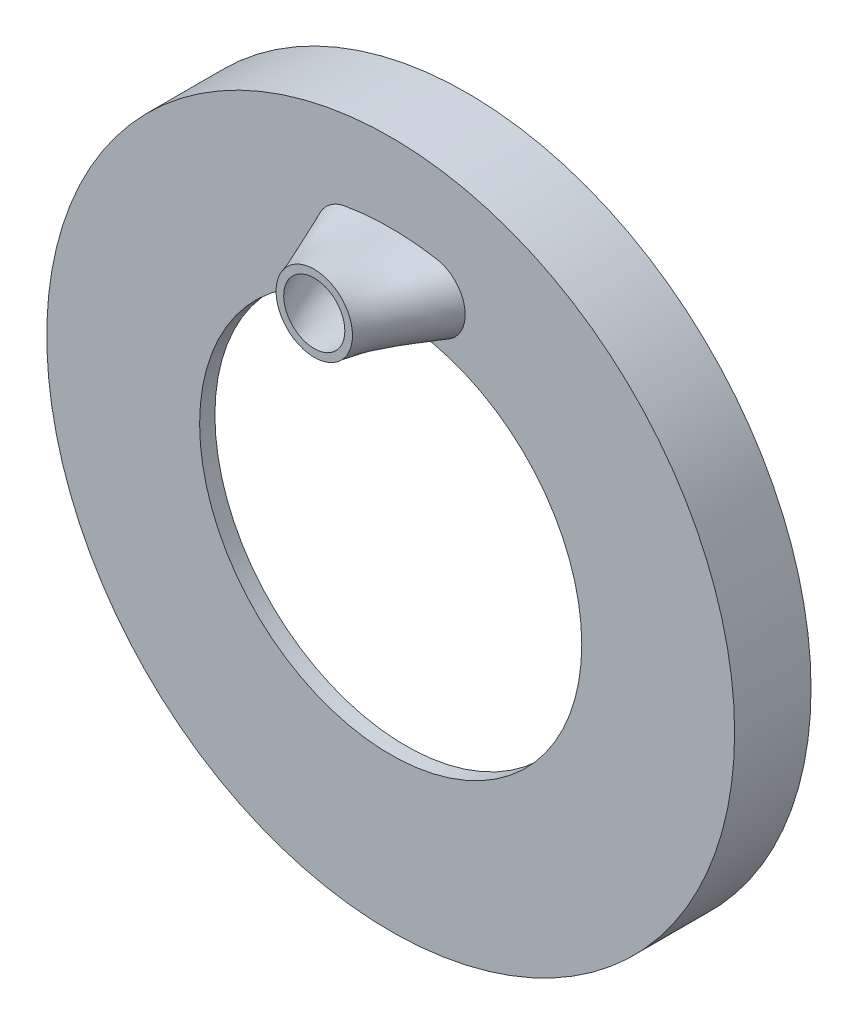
ISO-10303-21;
HEADER;
FILE_DESCRIPTION(('STEP AP214'),'2;1');
FILE_NAME('part.step','',(''),(''),'','','');
FILE_SCHEMA(('AUTOMOTIVE_DESIGN { 1 0 10303 214 1 1 1 1 }'));
ENDSEC;
DATA;
#1=APPLICATION_CONTEXT('core data for automotive mechanical design processes');
#2=APPLICATION_PROTOCOL_DEFINITION('international standard','automotive_design',2000,#1);
#3=PRODUCT_CONTEXT('',#1,'mechanical');
#4=PRODUCT('Part','Part','',(#3));
#5=PRODUCT_RELATED_PRODUCT_CATEGORY('part','',(#4));
#6=PRODUCT_DEFINITION_FORMATION('','',#4);
#7=PRODUCT_DEFINITION_CONTEXT('part definition',#1,'design');
#8=PRODUCT_DEFINITION('design','',#6,#7);
#9=PRODUCT_DEFINITION_SHAPE('','',#8);
#10=(LENGTH_UNIT() NAMED_UNIT(*) SI_UNIT(.MILLI.,.METRE.));
#11=(NAMED_UNIT(*) PLANE_ANGLE_UNIT() SI_UNIT($,.RADIAN.));
#12=(NAMED_UNIT(*) SI_UNIT($,.STERADIAN.) SOLID_ANGLE_UNIT());
#13=UNCERTAINTY_MEASURE_WITH_UNIT(LENGTH_MEASURE(1.E-05),#10,'distance_accuracy_value','');
#14=(GEOMETRIC_REPRESENTATION_CONTEXT(3) GLOBAL_UNCERTAINTY_ASSIGNED_CONTEXT((#13)) GLOBAL_UNIT_ASSIGNED_CONTEXT((#10,
#11,#12)) REPRESENTATION_CONTEXT('',''));
#15=CARTESIAN_POINT('',(0.,0.,0.));
#16=DIRECTION('',(0.,0.,1.));
#17=DIRECTION('',(1.,0.,0.));
#18=AXIS2_PLACEMENT_3D('',#15,#16,#17);
#19=CARTESIAN_POINT('',(0.,0.,2.));
#20=DIRECTION('',(0.,0.,1.));
#21=DIRECTION('',(1.,0.,0.));
#22=AXIS2_PLACEMENT_3D('',#19,#20,#21);
#23=PLANE('',#22);
#24=CARTESIAN_POINT('',(0.,0.,2.));
#25=DIRECTION('',(0.,0.,1.));
#26=DIRECTION('',(1.,0.,0.));
#27=AXIS2_PLACEMENT_3D('',#24,#25,#26);
#28=CIRCLE('',#27,25.);
#29=CARTESIAN_POINT('',(25.,0.,2.));
#30=VERTEX_POINT('',#29);
#31=EDGE_CURVE('E426',#30,#30,#28,.T.);
#32=ORIENTED_EDGE('',*,*,#31,.F.);
#33=EDGE_LOOP('',(#32));
#34=FACE_BOUND('',#33,.T.);
#35=CARTESIAN_POINT('',(0.,0.,2.));
#36=DIRECTION('',(0.,0.,1.));
#37=DIRECTION('',(1.,0.,0.));
#38=AXIS2_PLACEMENT_3D('',#35,#36,#37);
#39=CIRCLE('',#38,45.);
#40=CARTESIAN_POINT('',(45.,0.,2.));
#41=VERTEX_POINT('',#40);
#42=EDGE_CURVE('E429',#41,#41,#39,.T.);
#43=ORIENTED_EDGE('',*,*,#42,.T.);
#44=EDGE_LOOP('',(#43));
#45=FACE_BOUND('',#44,.T.);
#46=CARTESIAN_POINT('',(4.46275816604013,25.3095592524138,2.));
#47=CARTESIAN_POINT('',(4.71172962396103,25.2656934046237,2.));
#48=CARTESIAN_POINT('',(4.9643897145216,25.2429222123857,2.));
#49=CARTESIAN_POINT('',(5.46978503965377,25.2397887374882,2.));
#50=CARTESIAN_POINT('',(5.72252008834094,25.2593958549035,2.));
#51=CARTESIAN_POINT('',(6.22125291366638,25.3411926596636,2.));
#52=CARTESIAN_POINT('',(6.46724767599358,25.4034010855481,2.));
#53=CARTESIAN_POINT('',(6.82564758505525,25.5265427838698,2.));
#54=CARTESIAN_POINT('',(6.94339008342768,25.572583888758,2.));
#55=CARTESIAN_POINT('',(7.17464037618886,25.6743578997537,2.));
#56=CARTESIAN_POINT('',(7.28814854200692,25.7300899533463,2.));
#57=CARTESIAN_POINT('',(7.51039040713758,25.8511651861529,2.));
#58=CARTESIAN_POINT('',(7.61910743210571,25.9165389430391,2.));
#59=CARTESIAN_POINT('',(7.83054752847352,26.0563617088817,2.));
#60=CARTESIAN_POINT('',(7.93327026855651,26.1308112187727,2.));
#61=CARTESIAN_POINT('',(8.13212330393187,26.2880554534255,2.));
#62=CARTESIAN_POINT('',(8.22825302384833,26.3708509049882,2.));
#63=CARTESIAN_POINT('',(8.41326793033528,26.5441779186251,2.));
#64=CARTESIAN_POINT('',(8.50215303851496,26.6347095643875,2.));
#65=CARTESIAN_POINT('',(8.6719291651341,26.8228105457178,2.));
#66=CARTESIAN_POINT('',(8.75282865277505,26.9203722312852,2.));
#67=CARTESIAN_POINT('',(8.90598947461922,27.1220483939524,2.));
#68=CARTESIAN_POINT('',(8.97825155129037,27.2261623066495,2.));
#69=CARTESIAN_POINT('',(9.11359730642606,27.4401705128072,2.));
#70=CARTESIAN_POINT('',(9.176682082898,27.5500641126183,2.));
#71=CARTESIAN_POINT('',(9.29346483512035,27.7747442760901,2.));
#72=CARTESIAN_POINT('',(9.34716153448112,27.8895315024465,2.));
#73=CARTESIAN_POINT('',(9.4446747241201,28.1228341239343,2.));
#74=CARTESIAN_POINT('',(9.48851965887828,28.2413376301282,2.));
#75=CARTESIAN_POINT('',(9.56617008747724,28.4815759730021,2.));
#76=CARTESIAN_POINT('',(9.59997702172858,28.6033103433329,2.));
#77=CARTESIAN_POINT('',(9.65707409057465,28.8492347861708,2.));
#78=CARTESIAN_POINT('',(9.68036354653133,28.9734250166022,2.));
#79=CARTESIAN_POINT('',(9.7162546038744,29.2233459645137,2.));
#80=CARTESIAN_POINT('',(9.7288552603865,29.3490768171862,2.));
#81=CARTESIAN_POINT('',(9.7435241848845,29.6009731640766,2.));
#82=CARTESIAN_POINT('',(9.74560687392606,29.7271378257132,2.));
#83=CARTESIAN_POINT('',(9.73931566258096,29.9792059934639,2.));
#84=CARTESIAN_POINT('',(9.73094176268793,30.1051094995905,2.));
#85=CARTESIAN_POINT('',(9.70375500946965,30.3557989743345,2.));
#86=CARTESIAN_POINT('',(9.68494136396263,30.480584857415,2.));
#87=CARTESIAN_POINT('',(9.63675610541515,30.7280958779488,2.));
#88=CARTESIAN_POINT('',(9.60738538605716,30.8508211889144,2.));
#89=CARTESIAN_POINT('',(9.5381374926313,31.0938694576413,2.));
#90=CARTESIAN_POINT('',(9.49821318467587,31.2141789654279,2.));
#91=CARTESIAN_POINT('',(9.40842293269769,31.4510429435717,2.));
#92=CARTESIAN_POINT('',(9.35855561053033,31.5675968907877,2.));
#93=CARTESIAN_POINT('',(9.24928097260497,31.7961399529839,2.));
#94=CARTESIAN_POINT('',(9.18987385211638,31.9081291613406,2.));
#95=CARTESIAN_POINT('',(9.06191096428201,32.1267386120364,2.));
#96=CARTESIAN_POINT('',(8.99335641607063,32.2333595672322,2.));
#97=CARTESIAN_POINT('',(8.84716984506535,32.4406360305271,2.));
#98=CARTESIAN_POINT('',(8.76951310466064,32.5412741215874,2.));
#99=CARTESIAN_POINT('',(8.60588552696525,32.73555805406,2.));
#100=CARTESIAN_POINT('',(8.51991384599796,32.8292031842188,2.));
#101=CARTESIAN_POINT('',(8.34038067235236,33.0089565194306,2.));
#102=CARTESIAN_POINT('',(8.24681720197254,33.0950627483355,2.));
#103=CARTESIAN_POINT('',(8.05281844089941,33.259131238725,2.));
#104=CARTESIAN_POINT('',(7.95238361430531,33.3370940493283,2.));
#105=CARTESIAN_POINT('',(7.74563490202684,33.4840373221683,2.));
#106=CARTESIAN_POINT('',(7.63934205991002,33.5530472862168,2.));
#107=CARTESIAN_POINT('',(7.42128595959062,33.6817250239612,2.));
#108=CARTESIAN_POINT('',(7.30952211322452,33.741391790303,2.));
#109=CARTESIAN_POINT('',(6.96756689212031,33.9057259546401,2.));
#110=CARTESIAN_POINT('',(6.73019049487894,33.9960964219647,2.));
#111=CARTESIAN_POINT('',(6.41133711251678,34.0878280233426,2.));
#112=CARTESIAN_POINT('',(6.33475731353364,34.1076935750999,2.));
#113=CARTESIAN_POINT('',(6.18078370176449,34.1433274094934,2.));
#114=CARTESIAN_POINT('',(6.10339144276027,34.1591024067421,2.));
#115=CARTESIAN_POINT('',(6.02559176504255,34.1728290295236,2.));
#116=B_SPLINE_CURVE_WITH_KNOTS('',3,(#46,#47,#48,#49,#50,#51,#52,#53,#54,#55,#56,#57,#58,#59,
#60,#61,#62,#63,#64,#65,#66,#67,#68,#69,#70,#71,#72,#73,#74,#75,#76,#77,#78,#79,#80,#81,#82,#83,
#84,#85,#86,#87,#88,#89,#90,#91,#92,#93,#94,#95,#96,#97,#98,#99,#100,#101,#102,#103,#104,#105,
#106,#107,#108,#109,#110,#111,#112,#113,#114,#115),.UNSPECIFIED.,.F.,.F.,(4,2,2,2,2,2,2,2,2,2,2,
2,2,2,2,2,2,2,2,2,2,2,2,2,2,2,2,2,2,2,2,2,2,2,4),(0.,0.757497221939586,1.51444766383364,
2.27173127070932,2.65065109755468,3.02953760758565,3.40965263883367,3.78978865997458,
4.16995781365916,4.55013108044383,4.92989671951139,5.3096296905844,5.68931719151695,
6.0690562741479,6.44768445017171,6.82625826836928,7.20485651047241,7.58348821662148,
7.96160064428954,8.33971305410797,8.71785415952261,9.0959632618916,9.47579045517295,
9.85567033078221,10.2355424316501,10.6153639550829,10.9962419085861,11.3771585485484,
11.7581747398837,12.1391652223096,12.5188665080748,12.8986087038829,13.6561993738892,
13.8934775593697,14.1303637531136),.UNSPECIFIED.);
#117=CARTESIAN_POINT('',(4.46275816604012,25.3095592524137,2.));
#118=VERTEX_POINT('',#117);
#119=CARTESIAN_POINT('',(6.02559176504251,34.1728290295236,2.));
#120=VERTEX_POINT('',#119);
#121=EDGE_CURVE('E401',#118,#120,#116,.T.);
#122=ORIENTED_EDGE('',*,*,#121,.F.);
#123=CARTESIAN_POINT('',(4.46275816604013,25.3095592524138,2.));
#124=CARTESIAN_POINT('',(4.30344442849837,25.3376633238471,2.));
#125=CARTESIAN_POINT('',(4.14387814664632,25.3643559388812,2.));
#126=CARTESIAN_POINT('',(3.82427556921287,25.414747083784,2.));
#127=CARTESIAN_POINT('',(3.66423927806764,25.4384456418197,2.));
#128=CARTESIAN_POINT('',(3.34371848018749,25.4826794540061,2.));
#129=CARTESIAN_POINT('',(3.18323394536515,25.5032145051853,2.));
#130=CARTESIAN_POINT('',(2.86188760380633,25.5410790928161,2.));
#131=CARTESIAN_POINT('',(2.70102579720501,25.558408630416,2.));
#132=CARTESIAN_POINT('',(2.37891483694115,25.5900053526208,2.));
#133=CARTESIAN_POINT('',(2.21766551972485,25.6042708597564,2.));
#134=CARTESIAN_POINT('',(1.89494320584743,25.6300075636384,2.));
#135=CARTESIAN_POINT('',(1.73347020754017,25.6414787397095,2.));
#136=CARTESIAN_POINT('',(1.41034421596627,25.6614480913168,2.));
#137=CARTESIAN_POINT('',(1.24869122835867,25.6699463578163,2.));
#138=CARTESIAN_POINT('',(0.925254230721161,25.6838708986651,2.));
#139=CARTESIAN_POINT('',(0.763470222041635,25.6892972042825,2.));
#140=CARTESIAN_POINT('',(0.441930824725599,25.6969713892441,2.));
#141=CARTESIAN_POINT('',(0.282176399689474,25.6992596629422,2.));
#142=CARTESIAN_POINT('',(-0.0373478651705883,25.70080962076,2.));
#143=CARTESIAN_POINT('',(-0.197117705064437,25.700071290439,2.));
#144=CARTESIAN_POINT('',(-0.516623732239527,25.695551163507,2.));
#145=CARTESIAN_POINT('',(-0.676359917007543,25.6917691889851,2.));
#146=CARTESIAN_POINT('',(-0.995731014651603,25.6811782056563,2.));
#147=CARTESIAN_POINT('',(-1.15536592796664,25.6743692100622,2.));
#148=CARTESIAN_POINT('',(-1.4743863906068,25.6577961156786,2.));
#149=CARTESIAN_POINT('',(-1.63377203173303,25.6480337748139,2.));
#150=CARTESIAN_POINT('',(-1.95234941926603,25.6257160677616,2.));
#151=CARTESIAN_POINT('',(-2.11154116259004,25.6131606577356,2.));
#152=CARTESIAN_POINT('',(-2.42965990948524,25.5852525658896,2.));
#153=CARTESIAN_POINT('',(-2.58858694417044,25.5699002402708,2.));
#154=CARTESIAN_POINT('',(-2.90610846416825,25.5361087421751,2.));
#155=CARTESIAN_POINT('',(-3.06470296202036,25.5176696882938,2.));
#156=CARTESIAN_POINT('',(-3.3266686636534,25.4845995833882,2.));
#157=CARTESIAN_POINT('',(-3.4301533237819,25.4708596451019,2.));
#158=CARTESIAN_POINT('',(-3.6369309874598,25.4420695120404,2.));
#159=CARTESIAN_POINT('',(-3.74022400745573,25.4270194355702,2.));
#160=CARTESIAN_POINT('',(-3.94683736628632,25.3956128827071,2.));
#161=CARTESIAN_POINT('',(-4.05015728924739,25.3792536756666,2.));
#162=CARTESIAN_POINT('',(-4.2566054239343,25.3453107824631,2.));
#163=CARTESIAN_POINT('',(-4.35973361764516,25.3277269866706,2.));
#164=CARTESIAN_POINT('',(-4.46275816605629,25.3095592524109,2.));
#165=B_SPLINE_CURVE_WITH_KNOTS('',3,(#123,#124,#125,#126,#127,#128,#129,#130,#131,#132,#133,
#134,#135,#136,#137,#138,#139,#140,#141,#142,#143,#144,#145,#146,#147,#148,#149,#150,#151,#152,
#153,#154,#155,#156,#157,#158,#159,#160,#161,#162,#163,#164),.UNSPECIFIED.,.F.,.F.,(4,2,2,2,2,2,
2,2,2,2,2,2,2,2,2,2,2,2,2,2,4),(0.,0.485319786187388,0.970635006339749,1.45598135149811,
1.94132752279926,2.42693873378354,2.9125535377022,3.39815348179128,3.88374848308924,
4.3630320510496,4.84231790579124,5.32163177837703,5.80094355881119,6.27997059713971,
6.75900515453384,7.23797874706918,7.71693394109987,8.03010474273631,8.34324729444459,
8.65706094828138,8.97090273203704),.UNSPECIFIED.);
#166=CARTESIAN_POINT('',(-4.46275816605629,25.3095592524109,2.));
#167=VERTEX_POINT('',#166);
#168=EDGE_CURVE('E214',#118,#167,#165,.T.);
#169=ORIENTED_EDGE('',*,*,#168,.T.);
#170=CARTESIAN_POINT('',(-6.02559176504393,34.1728290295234,2.));
#171=CARTESIAN_POINT('',(-6.15003842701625,34.1508765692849,2.));
#172=CARTESIAN_POINT('',(-6.27354654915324,34.1236450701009,2.));
#173=CARTESIAN_POINT('',(-6.51785481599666,34.0589148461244,2.));
#174=CARTESIAN_POINT('',(-6.63865472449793,34.0214152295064,2.));
#175=CARTESIAN_POINT('',(-6.87660519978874,33.9364751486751,2.));
#176=CARTESIAN_POINT('',(-6.9937584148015,33.8890421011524,2.));
#177=CARTESIAN_POINT('',(-7.2236657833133,33.7845036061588,2.));
#178=CARTESIAN_POINT('',(-7.3364201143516,33.7273985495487,2.));
#179=CARTESIAN_POINT('',(-7.55671947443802,33.6037623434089,2.));
#180=CARTESIAN_POINT('',(-7.66426159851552,33.5372260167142,2.));
#181=CARTESIAN_POINT('',(-7.87334034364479,33.3953398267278,2.));
#182=CARTESIAN_POINT('',(-7.97487768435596,33.3199910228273,2.));
#183=CARTESIAN_POINT('',(-8.17127149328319,33.1611466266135,2.));
#184=CARTESIAN_POINT('',(-8.26613163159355,33.0776555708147,2.));
#185=CARTESIAN_POINT('',(-8.44863063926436,32.9029756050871,2.));
#186=CARTESIAN_POINT('',(-8.53626349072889,32.811780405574,2.));
#187=CARTESIAN_POINT('',(-8.70376518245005,32.6220341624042,2.));
#188=CARTESIAN_POINT('',(-8.78361053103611,32.5234623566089,2.));
#189=CARTESIAN_POINT('',(-8.93456523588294,32.3197727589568,2.));
#190=CARTESIAN_POINT('',(-9.00567047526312,32.214651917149,2.));
#191=CARTESIAN_POINT('',(-9.13880041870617,31.9987910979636,2.));
#192=CARTESIAN_POINT('',(-9.20082356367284,31.8880501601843,2.));
#193=CARTESIAN_POINT('',(-9.3153906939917,31.6618302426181,2.));
#194=CARTESIAN_POINT('',(-9.3679385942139,31.5463532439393,2.));
#195=CARTESIAN_POINT('',(-9.46313229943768,31.3115452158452,2.));
#196=CARTESIAN_POINT('',(-9.50579078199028,31.1922193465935,2.));
#197=CARTESIAN_POINT('',(-9.58076934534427,30.9505513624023,2.));
#198=CARTESIAN_POINT('',(-9.61310111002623,30.8282128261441,2.));
#199=CARTESIAN_POINT('',(-9.69417686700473,30.4575617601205,2.));
#200=CARTESIAN_POINT('',(-9.72703985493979,30.2055190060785,2.));
#201=CARTESIAN_POINT('',(-9.74478924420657,29.8268146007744,2.));
#202=CARTESIAN_POINT('',(-9.74546370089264,29.7006036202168,2.));
#203=CARTESIAN_POINT('',(-9.73632418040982,29.4485302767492,2.));
#204=CARTESIAN_POINT('',(-9.72651206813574,29.3226678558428,2.));
#205=CARTESIAN_POINT('',(-9.69627055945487,29.072217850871,2.));
#206=CARTESIAN_POINT('',(-9.67584004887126,28.9476304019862,2.));
#207=CARTESIAN_POINT('',(-9.62435624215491,28.7006618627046,2.));
#208=CARTESIAN_POINT('',(-9.5933023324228,28.5782809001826,2.));
#209=CARTESIAN_POINT('',(-9.52106001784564,28.336527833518,2.));
#210=CARTESIAN_POINT('',(-9.4798695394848,28.2171563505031,2.));
#211=CARTESIAN_POINT('',(-9.38772793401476,27.9822409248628,2.));
#212=CARTESIAN_POINT('',(-9.33677646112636,27.8666971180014,2.));
#213=CARTESIAN_POINT('',(-9.22544656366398,27.6402201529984,2.));
#214=CARTESIAN_POINT('',(-9.16506766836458,27.5292872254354,2.));
#215=CARTESIAN_POINT('',(-9.03517712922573,27.3129594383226,2.));
#216=CARTESIAN_POINT('',(-8.96566604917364,27.2075642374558,2.));
#217=CARTESIAN_POINT('',(-8.74317887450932,26.8998116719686,1.99999999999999));
#218=CARTESIAN_POINT('',(-8.57673216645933,26.7068748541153,2.));
#219=CARTESIAN_POINT('',(-8.30515886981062,26.4405521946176,2.));
#220=CARTESIAN_POINT('',(-8.21096044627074,26.3556087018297,2.));
#221=CARTESIAN_POINT('',(-8.01567482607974,26.1937839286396,2.));
#222=CARTESIAN_POINT('',(-7.9145819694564,26.1169094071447,2.));
#223=CARTESIAN_POINT('',(-7.70620696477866,25.9720584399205,2.));
#224=CARTESIAN_POINT('',(-7.598924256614,25.9040828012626,2.));
#225=CARTESIAN_POINT('',(-7.37889306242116,25.77753406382,2.));
#226=CARTESIAN_POINT('',(-7.26614243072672,25.7189646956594,2.));
#227=CARTESIAN_POINT('',(-7.03611867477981,25.6115287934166,2.));
#228=CARTESIAN_POINT('',(-6.91884570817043,25.5626619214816,2.));
#229=CARTESIAN_POINT('',(-6.68063784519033,25.4749292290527,2.));
#230=CARTESIAN_POINT('',(-6.55970342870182,25.4360621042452,2.));
#231=CARTESIAN_POINT('',(-6.31536158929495,25.3687341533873,2.));
#232=CARTESIAN_POINT('',(-6.19196310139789,25.3402411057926,2.));
#233=CARTESIAN_POINT('',(-5.94322251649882,25.2938699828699,2.));
#234=CARTESIAN_POINT('',(-5.81788019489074,25.2759931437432,2.));
#235=CARTESIAN_POINT('',(-5.44060026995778,25.2384194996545,2.));
#236=CARTESIAN_POINT('',(-5.18679573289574,25.2346112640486,2.));
#237=CARTESIAN_POINT('',(-4.85567786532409,25.2573656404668,2.));
#238=CARTESIAN_POINT('',(-4.77664649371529,25.2648983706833,2.));
#239=CARTESIAN_POINT('',(-4.61922346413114,25.2841196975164,2.));
#240=CARTESIAN_POINT('',(-4.5408309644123,25.2958014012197,2.));
#241=CARTESIAN_POINT('',(-4.46275816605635,25.3095592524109,2.));
#242=B_SPLINE_CURVE_WITH_KNOTS('',3,(#170,#171,#172,#173,#174,#175,#176,#177,#178,#179,#180,
#181,#182,#183,#184,#185,#186,#187,#188,#189,#190,#191,#192,#193,#194,#195,#196,#197,#198,#199,
#200,#201,#202,#203,#204,#205,#206,#207,#208,#209,#210,#211,#212,#213,#214,#215,#216,#217,#218,
#219,#220,#221,#222,#223,#224,#225,#226,#227,#228,#229,#230,#231,#232,#233,#234,#235,#236,#237,
#238,#239,#240,#241),.UNSPECIFIED.,.F.,.F.,(4,2,2,2,2,2,2,2,2,2,2,2,2,2,2,2,2,2,2,2,2,2,2,2,2,2,
2,2,2,2,2,2,2,2,2,4),(0.,0.378981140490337,0.757995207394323,1.13672729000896,1.51544407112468,
1.89436955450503,2.2732495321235,2.65191960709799,3.03090186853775,3.41099412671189,
3.79126474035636,4.17160055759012,4.55177887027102,4.93146709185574,5.31072419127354,
6.06893535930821,6.44726115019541,6.82551967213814,7.2038178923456,7.58213796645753,
7.96053549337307,8.33894642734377,8.71737626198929,9.09578274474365,9.85585259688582,
10.2360571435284,10.6165776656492,10.997132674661,11.3778382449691,11.7585305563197,
12.1391731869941,12.5186232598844,12.8981175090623,13.6552188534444,13.8933213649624,
14.1310301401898),.UNSPECIFIED.);
#243=CARTESIAN_POINT('',(-6.02559176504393,34.1728290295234,2.));
#244=VERTEX_POINT('',#243);
#245=EDGE_CURVE('E337',#244,#167,#242,.T.);
#246=ORIENTED_EDGE('',*,*,#245,.F.);
#247=CARTESIAN_POINT('',(6.02559176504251,34.1728290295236,2.));
#248=CARTESIAN_POINT('',(5.86892865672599,34.2004544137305,2.));
#249=CARTESIAN_POINT('',(5.7120848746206,34.2270430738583,2.));
#250=CARTESIAN_POINT('',(5.39804915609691,34.2780855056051,2.));
#251=CARTESIAN_POINT('',(5.24085721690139,34.3025392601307,2.));
#252=CARTESIAN_POINT('',(4.76883194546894,34.3725980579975,2.));
#253=CARTESIAN_POINT('',(4.45350014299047,34.4149093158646,2.));
#254=CARTESIAN_POINT('',(3.98046639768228,34.4715869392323,2.));
#255=CARTESIAN_POINT('',(3.82315778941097,34.4893136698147,2.));
#256=CARTESIAN_POINT('',(3.5083090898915,34.522585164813,2.));
#257=CARTESIAN_POINT('',(3.35076899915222,34.5381299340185,2.));
#258=CARTESIAN_POINT('',(3.03547852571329,34.5671096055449,2.));
#259=CARTESIAN_POINT('',(2.87772812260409,34.5805442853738,2.));
#260=CARTESIAN_POINT('',(2.56206191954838,34.6053371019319,2.));
#261=CARTESIAN_POINT('',(2.40414611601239,34.6166951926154,2.));
#262=CARTESIAN_POINT('',(1.90273017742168,34.6493471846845,2.));
#263=CARTESIAN_POINT('',(1.55896009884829,34.6666552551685,2.));
#264=CARTESIAN_POINT('',(0.87104575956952,34.6908959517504,2.));
#265=CARTESIAN_POINT('',(0.526901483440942,34.6978281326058,2.));
#266=CARTESIAN_POINT('',(-0.161512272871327,34.7014683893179,2.));
#267=CARTESIAN_POINT('',(-0.505781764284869,34.6981743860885,2.));
#268=CARTESIAN_POINT('',(-1.19406624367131,34.6812272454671,2.));
#269=CARTESIAN_POINT('',(-1.53808123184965,34.6675741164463,2.));
#270=CARTESIAN_POINT('',(-2.2291220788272,34.6298317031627,2.));
#271=CARTESIAN_POINT('',(-2.57614205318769,34.6056353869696,2.));
#272=CARTESIAN_POINT('',(-3.2693350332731,34.5472198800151,2.));
#273=CARTESIAN_POINT('',(-3.61550804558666,34.5130007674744,2.));
#274=CARTESIAN_POINT('',(-4.30658245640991,34.4338837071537,2.));
#275=CARTESIAN_POINT('',(-4.65148406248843,34.3889875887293,2.));
#276=CARTESIAN_POINT('',(-5.16767512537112,34.3137413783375,2.));
#277=CARTESIAN_POINT('',(-5.33955020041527,34.2873414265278,2.));
#278=CARTESIAN_POINT('',(-5.68288641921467,34.2319841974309,2.));
#279=CARTESIAN_POINT('',(-5.85434756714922,34.2030269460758,2.));
#280=CARTESIAN_POINT('',(-6.02559176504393,34.1728290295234,2.));
#281=B_SPLINE_CURVE_WITH_KNOTS('',3,(#247,#248,#249,#250,#251,#252,#253,#254,#255,#256,#257,
#258,#259,#260,#261,#262,#263,#264,#265,#266,#267,#268,#269,#270,#271,#272,#273,#274,#275,#276,
#277,#278,#279,#280),.UNSPECIFIED.,.F.,.F.,(4,2,2,2,2,2,2,2,2,2,2,2,2,2,2,2,4),(0.,
0.477232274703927,0.954468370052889,1.90879127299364,2.3836922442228,2.85859217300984,
3.33354214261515,3.8085026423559,4.84095005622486,5.87344177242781,6.90614341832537,
7.93884422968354,8.98228234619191,10.0257123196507,11.0689636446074,11.5906194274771,
12.1122699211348),.UNSPECIFIED.);
#282=EDGE_CURVE('E372',#120,#244,#281,.T.);
#283=ORIENTED_EDGE('',*,*,#282,.F.);
#284=EDGE_LOOP('',(#122,#169,#246,#283));
#285=FACE_BOUND('',#284,.T.);
#286=ADVANCED_FACE('F191',(#34,#45,#285),#23,.T.);
#287=CARTESIAN_POINT('',(0.,0.,0.));
#288=DIRECTION('',(0.,0.,1.));
#289=DIRECTION('',(1.,0.,0.));
#290=AXIS2_PLACEMENT_3D('',#287,#288,#289);
#291=PLANE('',#290);
#292=CARTESIAN_POINT('',(0.,0.,0.));
#293=DIRECTION('',(0.,0.,-1.));
#294=DIRECTION('',(-1.,0.,0.));
#295=AXIS2_PLACEMENT_3D('',#292,#293,#294);
#296=CIRCLE('',#295,34.2);
#297=CARTESIAN_POINT('',(-5.93876767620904,33.6804251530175,0.));
#298=VERTEX_POINT('',#297);
#299=CARTESIAN_POINT('',(5.93876767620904,33.6804251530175,0.));
#300=VERTEX_POINT('',#299);
#301=EDGE_CURVE('E265',#298,#300,#296,.T.);
#302=ORIENTED_EDGE('',*,*,#301,.F.);
#303=CARTESIAN_POINT('',(-5.24417496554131,29.7411941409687,0.));
#304=DIRECTION('',(0.,0.,-1.));
#305=DIRECTION('',(-1.,0.,0.));
#306=AXIS2_PLACEMENT_3D('',#303,#304,#305);
#307=CIRCLE('',#306,4.);
#308=CARTESIAN_POINT('',(-4.54958225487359,25.8019631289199,0.));
#309=VERTEX_POINT('',#308);
#310=EDGE_CURVE('E473',#309,#298,#307,.T.);
#311=ORIENTED_EDGE('',*,*,#310,.F.);
#312=CARTESIAN_POINT('',(0.,0.,0.));
#313=DIRECTION('',(0.,0.,1.));
#314=DIRECTION('',(-1.,0.,0.));
#315=AXIS2_PLACEMENT_3D('',#312,#313,#314);
#316=CIRCLE('',#315,26.2);
#317=CARTESIAN_POINT('',(4.54958225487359,25.8019631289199,0.));
#318=VERTEX_POINT('',#317);
#319=EDGE_CURVE('E408',#318,#309,#316,.T.);
#320=ORIENTED_EDGE('',*,*,#319,.F.);
#321=CARTESIAN_POINT('',(5.24417496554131,29.7411941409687,0.));
#322=DIRECTION('',(0.,0.,-1.));
#323=DIRECTION('',(-1.,0.,0.));
#324=AXIS2_PLACEMENT_3D('',#321,#322,#323);
#325=CIRCLE('',#324,4.);
#326=EDGE_CURVE('E472',#300,#318,#325,.T.);
#327=ORIENTED_EDGE('',*,*,#326,.F.);
#328=EDGE_LOOP('',(#302,#311,#320,#327));
#329=FACE_BOUND('',#328,.T.);
#330=CARTESIAN_POINT('',(0.,0.,0.));
#331=DIRECTION('',(0.,0.,1.));
#332=DIRECTION('',(1.,0.,0.));
#333=AXIS2_PLACEMENT_3D('',#330,#331,#332);
#334=CIRCLE('',#333,25.);
#335=CARTESIAN_POINT('',(25.,0.,0.));
#336=VERTEX_POINT('',#335);
#337=EDGE_CURVE('E421',#336,#336,#334,.T.);
#338=ORIENTED_EDGE('',*,*,#337,.T.);
#339=EDGE_LOOP('',(#338));
#340=FACE_BOUND('',#339,.T.);
#341=CARTESIAN_POINT('',(0.,0.,0.));
#342=DIRECTION('',(0.,0.,1.));
#343=DIRECTION('',(1.,0.,0.));
#344=AXIS2_PLACEMENT_3D('',#341,#342,#343);
#345=CIRCLE('',#344,44.);
#346=CARTESIAN_POINT('',(44.,0.,0.));
#347=VERTEX_POINT('',#346);
#348=EDGE_CURVE('E258',#347,#347,#345,.T.);
#349=ORIENTED_EDGE('',*,*,#348,.F.);
#350=EDGE_LOOP('',(#349));
#351=FACE_BOUND('',#350,.T.);
#352=ADVANCED_FACE('F394',(#329,#340,#351),#291,.F.);
#353=CARTESIAN_POINT('',(0.,0.,2.));
#354=DIRECTION('',(0.,0.,-1.));
#355=DIRECTION('',(-1.,0.,0.));
#356=AXIS2_PLACEMENT_3D('',#353,#354,#355);
#357=CYLINDRICAL_SURFACE('',#356,45.);
#358=ORIENTED_EDGE('',*,*,#42,.F.);
#359=EDGE_LOOP('',(#358));
#360=FACE_BOUND('',#359,.T.);
#361=CARTESIAN_POINT('',(0.,0.,-8.));
#362=DIRECTION('',(0.,0.,1.));
#363=DIRECTION('',(1.,0.,0.));
#364=AXIS2_PLACEMENT_3D('',#361,#362,#363);
#365=CIRCLE('',#364,45.);
#366=CARTESIAN_POINT('',(45.,0.,-8.));
#367=VERTEX_POINT('',#366);
#368=EDGE_CURVE('E416',#367,#367,#365,.T.);
#369=ORIENTED_EDGE('',*,*,#368,.T.);
#370=EDGE_LOOP('',(#369));
#371=FACE_BOUND('',#370,.T.);
#372=ADVANCED_FACE('F193',(#360,#371),#357,.T.);
#373=CARTESIAN_POINT('',(0.,0.,2.));
#374=DIRECTION('',(0.,0.,-1.));
#375=DIRECTION('',(-1.,0.,0.));
#376=AXIS2_PLACEMENT_3D('',#373,#374,#375);
#377=CYLINDRICAL_SURFACE('',#376,25.);
#378=ORIENTED_EDGE('',*,*,#31,.T.);
#379=EDGE_LOOP('',(#378));
#380=FACE_BOUND('',#379,.T.);
#381=ORIENTED_EDGE('',*,*,#337,.F.);
#382=EDGE_LOOP('',(#381));
#383=FACE_BOUND('',#382,.T.);
#384=ADVANCED_FACE('F396',(#380,#383),#377,.F.);
#385=CARTESIAN_POINT('',(0.,0.,-8.));
#386=DIRECTION('',(0.,0.,1.));
#387=DIRECTION('',(1.,0.,0.));
#388=AXIS2_PLACEMENT_3D('',#385,#386,#387);
#389=CYLINDRICAL_SURFACE('',#388,44.);
#390=CARTESIAN_POINT('',(0.,0.,-8.));
#391=DIRECTION('',(0.,0.,1.));
#392=DIRECTION('',(1.,0.,0.));
#393=AXIS2_PLACEMENT_3D('',#390,#391,#392);
#394=CIRCLE('',#393,44.);
#395=CARTESIAN_POINT('',(44.,0.,-8.));
#396=VERTEX_POINT('',#395);
#397=EDGE_CURVE('E411',#396,#396,#394,.T.);
#398=ORIENTED_EDGE('',*,*,#397,.F.);
#399=EDGE_LOOP('',(#398));
#400=FACE_BOUND('',#399,.T.);
#401=ORIENTED_EDGE('',*,*,#348,.T.);
#402=EDGE_LOOP('',(#401));
#403=FACE_BOUND('',#402,.T.);
#404=ADVANCED_FACE('F436',(#400,#403),#389,.F.);
#405=CARTESIAN_POINT('',(0.,0.,-8.));
#406=DIRECTION('',(0.,0.,1.));
#407=DIRECTION('',(1.,0.,0.));
#408=AXIS2_PLACEMENT_3D('',#405,#406,#407);
#409=PLANE('',#408);
#410=ORIENTED_EDGE('',*,*,#397,.T.);
#411=EDGE_LOOP('',(#410));
#412=FACE_BOUND('',#411,.T.);
#413=ORIENTED_EDGE('',*,*,#368,.F.);
#414=EDGE_LOOP('',(#413));
#415=FACE_BOUND('',#414,.T.);
#416=ADVANCED_FACE('F453',(#412,#415),#409,.F.);
#417=CARTESIAN_POINT('',(-5.24417496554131,29.7411941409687,5.));
#418=DIRECTION('',(0.,0.,-1.));
#419=DIRECTION('',(-1.,0.,0.));
#420=AXIS2_PLACEMENT_3D('',#417,#418,#419);
#421=CYLINDRICAL_SURFACE('',#420,4.);
#422=CARTESIAN_POINT('',(-5.93876767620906,33.6804251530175,2.));
#423=CARTESIAN_POINT('',(-5.99416776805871,33.6706565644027,1.99998961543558));
#424=CARTESIAN_POINT('',(-6.04935499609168,33.6597204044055,1.99993840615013));
#425=CARTESIAN_POINT('',(-6.15921795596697,33.6355311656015,1.9998193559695));
#426=CARTESIAN_POINT('',(-6.2138936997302,33.6222781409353,1.99975151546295));
#427=CARTESIAN_POINT('',(-6.37700066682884,33.579077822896,1.9996205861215));
#428=CARTESIAN_POINT('',(-6.48454050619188,33.5456841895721,1.99963001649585));
#429=CARTESIAN_POINT('',(-6.69633479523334,33.4699840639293,1.99981889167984));
#430=CARTESIAN_POINT('',(-6.80059149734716,33.4276838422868,1.99999821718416));
#431=CARTESIAN_POINT('',(-7.00517503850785,33.3344535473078,2.00031479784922));
#432=CARTESIAN_POINT('',(-7.1055019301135,33.2835235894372,2.00045205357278));
#433=CARTESIAN_POINT('',(-7.30155568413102,33.1733704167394,2.00035932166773));
#434=CARTESIAN_POINT('',(-7.39728035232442,33.1141432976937,2.00012916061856));
#435=CARTESIAN_POINT('',(-7.58339984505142,32.9878347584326,1.99972695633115));
#436=CARTESIAN_POINT('',(-7.67379466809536,32.920753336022,1.99955491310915));
#437=CARTESIAN_POINT('',(-7.84859434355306,32.7792269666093,1.99948751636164));
#438=CARTESIAN_POINT('',(-7.93300035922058,32.704783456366,1.99959210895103));
#439=CARTESIAN_POINT('',(-8.09524127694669,32.5490517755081,1.99993847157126));
#440=CARTESIAN_POINT('',(-8.1730762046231,32.4677636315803,2.00018024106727));
#441=CARTESIAN_POINT('',(-8.32162369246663,32.2989183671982,2.00051119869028));
#442=CARTESIAN_POINT('',(-8.39233614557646,32.2113611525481,2.00060038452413));
#443=CARTESIAN_POINT('',(-8.52613435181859,32.0306016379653,2.00038946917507));
#444=CARTESIAN_POINT('',(-8.58922008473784,31.9373993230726,2.00008936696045));
#445=CARTESIAN_POINT('',(-8.70732560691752,31.7459972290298,1.99964504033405));
#446=CARTESIAN_POINT('',(-8.76234417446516,31.6477966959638,1.99950083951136));
#447=CARTESIAN_POINT('',(-8.86391257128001,31.4471095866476,1.99947008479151));
#448=CARTESIAN_POINT('',(-8.91046240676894,31.3446230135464,1.99958353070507));
#449=CARTESIAN_POINT('',(-8.99475830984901,31.136102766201,1.99996870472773));
#450=CARTESIAN_POINT('',(-9.03250520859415,31.0300694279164,2.00024041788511));
#451=CARTESIAN_POINT('',(-9.09893276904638,30.8151995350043,2.00059336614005));
#452=CARTESIAN_POINT('',(-9.1276134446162,30.7063629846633,2.00067460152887));
#453=CARTESIAN_POINT('',(-9.17570295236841,30.4866681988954,2.00044021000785));
#454=CARTESIAN_POINT('',(-9.19511237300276,30.3758100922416,2.00012460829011));
#455=CARTESIAN_POINT('',(-9.22452431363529,30.1528527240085,1.99963040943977));
#456=CARTESIAN_POINT('',(-9.23452683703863,30.0407534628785,1.99945181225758));
#457=CARTESIAN_POINT('',(-9.24505407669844,29.816104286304,1.99935910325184));
#458=CARTESIAN_POINT('',(-9.24557826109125,29.7035543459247,1.99944500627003));
#459=CARTESIAN_POINT('',(-9.23714381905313,29.4788106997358,1.99982783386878));
#460=CARTESIAN_POINT('',(-9.22818517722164,29.3666169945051,2.00012475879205));
#461=CARTESIAN_POINT('',(-9.20084828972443,29.1433799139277,2.00057300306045));
#462=CARTESIAN_POINT('',(-9.18246983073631,29.0323365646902,2.00072431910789));
#463=CARTESIAN_POINT('',(-9.13642412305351,28.8121932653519,2.00058679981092));
#464=CARTESIAN_POINT('',(-9.10875686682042,28.7030933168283,2.00029796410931));
#465=CARTESIAN_POINT('',(-9.04433084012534,28.4876154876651,1.99978574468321));
#466=CARTESIAN_POINT('',(-9.00757244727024,28.3812374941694,1.99956235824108));
#467=CARTESIAN_POINT('',(-8.92522749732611,28.1719590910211,1.99936401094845));
#468=CARTESIAN_POINT('',(-8.87964095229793,28.0690586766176,1.99938904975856));
#469=CARTESIAN_POINT('',(-8.77995386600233,27.8674521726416,1.99968251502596));
#470=CARTESIAN_POINT('',(-8.72585334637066,27.7687460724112,1.99995094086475));
#471=CARTESIAN_POINT('',(-8.63862770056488,27.624391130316,2.00032807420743));
#472=CARTESIAN_POINT('',(-8.60853633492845,27.5768851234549,2.00044954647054));
#473=CARTESIAN_POINT('',(-8.5463784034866,27.4831832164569,2.00060054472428));
#474=CARTESIAN_POINT('',(-8.51431183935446,27.43698731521,2.00063007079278));
#475=CARTESIAN_POINT('',(-8.41523307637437,27.3004919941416,2.00057573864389));
#476=CARTESIAN_POINT('',(-8.34533017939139,27.2122657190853,2.00034903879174));
#477=CARTESIAN_POINT('',(-8.19834878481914,27.0420263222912,1.99990178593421));
#478=CARTESIAN_POINT('',(-8.12127027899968,26.96001320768,1.99968123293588));
#479=CARTESIAN_POINT('',(-7.9604832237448,26.8027739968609,1.99946424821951));
#480=CARTESIAN_POINT('',(-7.87677499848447,26.7275475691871,1.99946780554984));
#481=CARTESIAN_POINT('',(-7.70330786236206,26.5844067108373,1.99972814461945));
#482=CARTESIAN_POINT('',(-7.6135489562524,26.5164922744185,1.99998492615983));
#483=CARTESIAN_POINT('',(-7.47488917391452,26.4204897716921,2.00032865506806));
#484=CARTESIAN_POINT('',(-7.42799632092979,26.3894655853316,2.00043632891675));
#485=CARTESIAN_POINT('',(-7.33294505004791,26.3294204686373,2.00054580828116));
#486=CARTESIAN_POINT('',(-7.28478663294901,26.30039953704,2.00054761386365));
#487=CARTESIAN_POINT('',(-7.13854271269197,26.2164241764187,2.00044443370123));
#488=CARTESIAN_POINT('',(-7.03866866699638,26.1645434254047,2.00023089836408));
#489=CARTESIAN_POINT('',(-6.83488510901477,26.0693695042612,1.9998219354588));
#490=CARTESIAN_POINT('',(-6.73097427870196,26.0260791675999,1.99962651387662));
#491=CARTESIAN_POINT('',(-6.51987426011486,25.9484065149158,1.99947344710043));
#492=CARTESIAN_POINT('',(-6.4126851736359,25.9140239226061,1.99951579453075));
#493=CARTESIAN_POINT('',(-6.19573623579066,25.8543967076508,1.99986373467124));
#494=CARTESIAN_POINT('',(-6.08597507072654,25.8291568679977,2.00016946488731));
#495=CARTESIAN_POINT('',(-5.86470045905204,25.7880166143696,2.00045728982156));
#496=CARTESIAN_POINT('',(-5.75318679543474,25.7721173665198,2.00043934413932));
#497=CARTESIAN_POINT('',(-5.5293708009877,25.7497913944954,2.00021399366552));
#498=CARTESIAN_POINT('',(-5.41706973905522,25.7433519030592,2.00000684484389));
#499=CARTESIAN_POINT('',(-5.19236834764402,25.7399528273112,1.99970052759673));
#500=CARTESIAN_POINT('',(-5.07996809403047,25.7429885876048,1.99960130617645));
#501=CARTESIAN_POINT('',(-4.89774424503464,25.7556030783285,1.99965760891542));
#502=CARTESIAN_POINT('',(-4.82770958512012,25.7623121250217,1.99973177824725));
#503=CARTESIAN_POINT('',(-4.68820666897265,25.7793978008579,1.99988603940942));
#504=CARTESIAN_POINT('',(-4.61873766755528,25.7897683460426,1.99996612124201));
#505=CARTESIAN_POINT('',(-4.54958225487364,25.8019631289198,2.));
#506=B_SPLINE_CURVE_WITH_KNOTS('',3,(#422,#423,#424,#425,#426,#427,#428,#429,#430,#431,#432,
#433,#434,#435,#436,#437,#438,#439,#440,#441,#442,#443,#444,#445,#446,#447,#448,#449,#450,#451,
#452,#453,#454,#455,#456,#457,#458,#459,#460,#461,#462,#463,#464,#465,#466,#467,#468,#469,#470,
#471,#472,#473,#474,#475,#476,#477,#478,#479,#480,#481,#482,#483,#484,#485,#486,#487,#488,#489,
#490,#491,#492,#493,#494,#495,#496,#497,#498,#499,#500,#501,#502,#503,#504,#505),.UNSPECIFIED.,
.F.,.F.,(4,2,2,2,2,2,2,2,2,2,2,2,2,2,2,2,2,2,2,2,2,2,2,2,2,2,2,2,2,2,2,2,2,2,2,2,2,2,2,2,2,4),
(0.,0.168737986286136,0.337472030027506,0.674852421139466,1.01199606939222,1.34913520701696,
1.68643352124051,2.02373192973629,2.36096464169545,2.69819603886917,3.03543250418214,
3.37266986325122,3.70995824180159,4.04724637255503,4.38450264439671,4.721758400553,
5.05899274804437,5.39622697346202,5.7334801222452,6.07073381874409,6.40799515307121,
6.74525676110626,7.08250436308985,7.41975150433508,7.7569977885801,7.92565832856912,
8.09431872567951,8.43157230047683,8.76882626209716,9.10606374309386,9.44330095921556,
9.61193810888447,9.78057515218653,10.1177769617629,10.4550898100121,10.792392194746,
11.1298707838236,11.4673914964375,11.8044562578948,12.1413554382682,12.3523314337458,
12.5629585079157),.UNSPECIFIED.);
#507=CARTESIAN_POINT('',(-5.93876767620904,33.6804251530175,2.));
#508=VERTEX_POINT('',#507);
#509=CARTESIAN_POINT('',(-4.54958225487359,25.8019631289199,2.));
#510=VERTEX_POINT('',#509);
#511=EDGE_CURVE('E12',#508,#510,#506,.T.);
#512=ORIENTED_EDGE('',*,*,#511,.T.);
#513=DIRECTION('',(0.,0.,-1.));
#514=VECTOR('',#513,1.);
#515=CARTESIAN_POINT('',(-4.54958225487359,25.8019631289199,5.));
#516=LINE('',#515,#514);
#517=EDGE_CURVE('E316',#510,#309,#516,.T.);
#518=ORIENTED_EDGE('',*,*,#517,.T.);
#519=ORIENTED_EDGE('',*,*,#310,.T.);
#520=DIRECTION('',(0.,0.,-1.));
#521=VECTOR('',#520,1.);
#522=CARTESIAN_POINT('',(-5.93876767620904,33.6804251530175,5.));
#523=LINE('',#522,#521);
#524=EDGE_CURVE('E270',#508,#298,#523,.T.);
#525=ORIENTED_EDGE('',*,*,#524,.F.);
#526=EDGE_LOOP('',(#512,#518,#519,#525));
#527=FACE_BOUND('',#526,.T.);
#528=ADVANCED_FACE('F300',(#527),#421,.F.);
#529=CARTESIAN_POINT('',(0.,0.,5.));
#530=DIRECTION('',(0.,0.,-1.));
#531=DIRECTION('',(-1.,0.,0.));
#532=AXIS2_PLACEMENT_3D('',#529,#530,#531);
#533=CYLINDRICAL_SURFACE('',#532,26.2);
#534=CARTESIAN_POINT('',(5.9387676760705,33.6804251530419,2.));
#535=CARTESIAN_POINT('',(6.39783003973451,33.5994800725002,2.));
#536=CARTESIAN_POINT('',(7.32590030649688,33.2687216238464,2.));
#537=CARTESIAN_POINT('',(8.5215143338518,32.2203203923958,2.));
#538=CARTESIAN_POINT('',(9.24891785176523,30.704975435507,2.));
#539=CARTESIAN_POINT('',(9.29459584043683,28.9766134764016,2.));
#540=CARTESIAN_POINT('',(8.62503299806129,27.3923584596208,2.));
#541=CARTESIAN_POINT('',(7.41751071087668,26.2581075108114,2.));
#542=CARTESIAN_POINT('',(5.95903926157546,25.7124108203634,2.));
#543=CARTESIAN_POINT('',(4.99761283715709,25.7229632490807,2.));
#544=CARTESIAN_POINT('',(4.10669436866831,25.8800562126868,2.));
#545=CARTESIAN_POINT('',(3.27947800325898,26.0041460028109,2.));
#546=CARTESIAN_POINT('',(2.14892735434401,26.1185475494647,2.));
#547=CARTESIAN_POINT('',(1.06324628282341,26.1857719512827,2.));
#548=CARTESIAN_POINT('',(0.,26.2075898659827,2.));
#549=CARTESIAN_POINT('',(-1.06324628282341,26.1857719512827,2.));
#550=CARTESIAN_POINT('',(-2.14892735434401,26.1185475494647,2.));
#551=CARTESIAN_POINT('',(-3.27947800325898,26.0041460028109,2.));
#552=CARTESIAN_POINT('',(-4.10669436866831,25.8800562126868,2.));
#553=CARTESIAN_POINT('',(-4.99761283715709,25.7229632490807,2.));
#554=CARTESIAN_POINT('',(-5.95903926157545,25.7124108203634,2.));
#555=CARTESIAN_POINT('',(-7.41751071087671,26.2581075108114,2.));
#556=CARTESIAN_POINT('',(-8.62503299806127,27.3923584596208,2.));
#557=CARTESIAN_POINT('',(-9.29459584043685,28.9766134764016,2.));
#558=CARTESIAN_POINT('',(-9.24891785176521,30.704975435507,2.));
#559=CARTESIAN_POINT('',(-8.5215143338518,32.2203203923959,2.));
#560=CARTESIAN_POINT('',(-7.32590030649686,33.2687216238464,2.));
#561=CARTESIAN_POINT('',(-6.3978300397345,33.5994800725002,2.));
#562=CARTESIAN_POINT('',(-4.84588029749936,33.8731306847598,2.));
#563=CARTESIAN_POINT('',(-3.3402449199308,34.0598062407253,2.));
#564=CARTESIAN_POINT('',(-1.41918323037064,34.1806067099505,2.));
#565=CARTESIAN_POINT('',(0.,34.2098943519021,2.));
#566=CARTESIAN_POINT('',(1.41918323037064,34.1806067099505,2.));
#567=CARTESIAN_POINT('',(3.3402449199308,34.0598062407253,2.));
#568=CARTESIAN_POINT('',(4.84588029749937,33.8731306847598,2.));
#569=CARTESIAN_POINT('',(5.9387676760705,33.6804251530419,2.));
#570=B_SPLINE_CURVE_WITH_KNOTS('',3,(#534,#535,#536,#537,#538,#539,#540,#541,#542,#543,#544,
#545,#546,#547,#548,#549,#550,#551,#552,#553,#554,#555,#556,#557,#558,#559,#560,#561,#562,#563,
#564,#565,#566,#567,#568,#569),.UNSPECIFIED.,.T.,.F.,(4,1,1,1,1,1,1,1,2,1,1,1,1,1,1,1,2,1,1,1,1,
1,1,1,2,1,1,1,1,1,4),(0.,0.0299124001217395,0.0598248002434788,0.0897372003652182,
0.119649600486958,0.149562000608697,0.179474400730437,0.209386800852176,0.239299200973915,
0.268868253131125,0.298437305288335,0.328006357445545,0.357575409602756,0.387144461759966,
0.416713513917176,0.446282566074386,0.475851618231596,0.505764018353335,0.535676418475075,
0.565588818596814,0.595501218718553,0.625413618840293,0.655326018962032,0.685238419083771,
0.715150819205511,0.786363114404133,0.821969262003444,0.857575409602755,0.893181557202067,
0.928787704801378,1.),.UNSPECIFIED.);
#571=CARTESIAN_POINT('',(4.54958225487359,25.8019631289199,2.));
#572=VERTEX_POINT('',#571);
#573=EDGE_CURVE('E207',#510,#572,#570,.F.);
#574=ORIENTED_EDGE('',*,*,#573,.T.);
#575=DIRECTION('',(0.,0.,-1.));
#576=VECTOR('',#575,1.);
#577=CARTESIAN_POINT('',(4.54958225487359,25.8019631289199,5.));
#578=LINE('',#577,#576);
#579=EDGE_CURVE('E269',#572,#318,#578,.T.);
#580=ORIENTED_EDGE('',*,*,#579,.T.);
#581=ORIENTED_EDGE('',*,*,#319,.T.);
#582=ORIENTED_EDGE('',*,*,#517,.F.);
#583=EDGE_LOOP('',(#574,#580,#581,#582));
#584=FACE_BOUND('',#583,.T.);
#585=ADVANCED_FACE('F295',(#584),#533,.T.);
#586=CARTESIAN_POINT('',(5.24417496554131,29.7411941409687,5.));
#587=DIRECTION('',(0.,0.,-1.));
#588=DIRECTION('',(-1.,0.,0.));
#589=AXIS2_PLACEMENT_3D('',#586,#587,#588);
#590=CYLINDRICAL_SURFACE('',#589,4.);
#591=CARTESIAN_POINT('',(4.54958225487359,25.8019631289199,2.));
#592=CARTESIAN_POINT('',(4.60498142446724,25.7921948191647,1.99998498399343));
#593=CARTESIAN_POINT('',(4.66057989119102,25.7835964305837,1.999926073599));
#594=CARTESIAN_POINT('',(4.77208977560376,25.7687515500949,1.99979458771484));
#595=CARTESIAN_POINT('',(4.82800119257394,25.7625050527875,1.99972201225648));
#596=CARTESIAN_POINT('',(4.99604650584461,25.7473141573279,1.99959499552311));
#597=CARTESIAN_POINT('',(5.10852150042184,25.7419130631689,1.99963117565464));
#598=CARTESIAN_POINT('',(5.33343253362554,25.7406097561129,1.99986913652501));
#599=CARTESIAN_POINT('',(5.44586854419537,25.7447008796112,2.00007080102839));
#600=CARTESIAN_POINT('',(5.6699994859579,25.7623365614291,2.00037978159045));
#601=CARTESIAN_POINT('',(5.78169442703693,25.7758809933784,2.0004870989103));
#602=CARTESIAN_POINT('',(6.00359731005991,25.8123358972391,2.00031452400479));
#603=CARTESIAN_POINT('',(6.11380453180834,25.8352507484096,2.00003445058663));
#604=CARTESIAN_POINT('',(6.33189907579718,25.8902846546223,1.99962788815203));
#605=CARTESIAN_POINT('',(6.43978637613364,25.9224037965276,1.99950140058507));
#606=CARTESIAN_POINT('',(6.65244672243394,25.9956079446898,1.99952847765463));
#607=CARTESIAN_POINT('',(6.75722038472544,26.0366911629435,1.99968198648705));
#608=CARTESIAN_POINT('',(6.96294666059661,26.1275444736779,2.0000691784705));
#609=CARTESIAN_POINT('',(7.06389929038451,26.1773145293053,2.00030286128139));
#610=CARTESIAN_POINT('',(7.21189262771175,26.2581995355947,2.0005037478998));
#611=CARTESIAN_POINT('',(7.26065699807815,26.2862034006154,2.00054576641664));
#612=CARTESIAN_POINT('',(7.35696240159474,26.3442410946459,2.00052628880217));
#613=CARTESIAN_POINT('',(7.40450343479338,26.3742749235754,2.00046479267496));
#614=CARTESIAN_POINT('',(7.5451590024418,26.4673419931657,2.00019394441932));
#615=CARTESIAN_POINT('',(7.63632775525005,26.5333527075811,1.9998982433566));
#616=CARTESIAN_POINT('',(7.81278307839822,26.6728224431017,1.99953007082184));
#617=CARTESIAN_POINT('',(7.89806875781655,26.7462825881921,1.99945763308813));
#618=CARTESIAN_POINT('',(8.06214897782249,26.9001256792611,1.99956523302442));
#619=CARTESIAN_POINT('',(8.14094351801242,26.9805086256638,1.99974527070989));
#620=CARTESIAN_POINT('',(8.2914806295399,27.147630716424,2.00017581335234));
#621=CARTESIAN_POINT('',(8.36322385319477,27.2343692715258,2.00042631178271));
#622=CARTESIAN_POINT('',(8.46515240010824,27.3687547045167,2.00060937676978));
#623=CARTESIAN_POINT('',(8.49818421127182,27.4142680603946,2.0006382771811));
#624=CARTESIAN_POINT('',(8.56230049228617,27.50664627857,2.00057833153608));
#625=CARTESIAN_POINT('',(8.59338496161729,27.5535111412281,2.00048948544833));
#626=CARTESIAN_POINT('',(8.68362499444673,27.6960000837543,2.00016216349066));
#627=CARTESIAN_POINT('',(8.73978669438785,27.7935442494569,1.99986288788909));
#628=CARTESIAN_POINT('',(8.84368668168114,27.9930053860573,1.99946711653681));
#629=CARTESIAN_POINT('',(8.89142498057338,28.0949223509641,1.9993706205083));
#630=CARTESIAN_POINT('',(8.97814961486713,28.3024177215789,1.99944988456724));
#631=CARTESIAN_POINT('',(9.01713568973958,28.4079962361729,1.999625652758));
#632=CARTESIAN_POINT('',(9.08607754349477,28.6220754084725,2.00009389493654));
#633=CARTESIAN_POINT('',(9.11603331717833,28.7305760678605,2.0003863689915));
#634=CARTESIAN_POINT('',(9.15402881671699,28.8949038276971,2.00064005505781));
#635=CARTESIAN_POINT('',(9.16553860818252,28.9499493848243,2.00069377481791));
#636=CARTESIAN_POINT('',(9.18622833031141,29.0604766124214,2.00067769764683));
#637=CARTESIAN_POINT('',(9.1954082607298,29.1159582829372,2.00060790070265));
#638=CARTESIAN_POINT('',(9.21942441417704,29.2829055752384,2.00031870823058));
#639=CARTESIAN_POINT('',(9.23074261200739,29.3948977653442,2.00001951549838));
#640=CARTESIAN_POINT('',(9.24390271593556,29.6194244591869,1.9995656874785));
#641=CARTESIAN_POINT('',(9.24574461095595,29.7319589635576,1.99941105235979));
#642=CARTESIAN_POINT('',(9.23994350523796,29.956783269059,1.99937717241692));
#643=CARTESIAN_POINT('',(9.23230050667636,30.0690730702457,1.99949792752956));
#644=CARTESIAN_POINT('',(9.20757879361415,30.2926221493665,1.99991857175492));
#645=CARTESIAN_POINT('',(9.19050010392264,30.4038814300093,2.00021846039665));
#646=CARTESIAN_POINT('',(9.15790629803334,30.5693677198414,2.00052751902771));
#647=CARTESIAN_POINT('',(9.14587735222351,30.6243020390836,2.00060707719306));
#648=CARTESIAN_POINT('',(9.11951519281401,30.7336150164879,2.00064796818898));
#649=CARTESIAN_POINT('',(9.10518197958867,30.7879936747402,2.00060930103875));
#650=CARTESIAN_POINT('',(9.05876240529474,30.9501435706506,2.00040259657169));
#651=CARTESIAN_POINT('',(9.02325085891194,31.0569553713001,2.00014388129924));
#652=CARTESIAN_POINT('',(8.9433601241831,31.2671949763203,1.99971355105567));
#653=CARTESIAN_POINT('',(8.89898093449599,31.3706227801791,1.99954193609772));
#654=CARTESIAN_POINT('',(8.8016714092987,31.5733682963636,1.99945144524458));
#655=CARTESIAN_POINT('',(8.74874148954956,31.6726862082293,1.99953255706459));
#656=CARTESIAN_POINT('',(8.6346953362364,31.8665206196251,1.99990156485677));
#657=CARTESIAN_POINT('',(8.57357910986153,31.9610371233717,2.00018946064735));
#658=CARTESIAN_POINT('',(8.47611777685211,32.098673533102,2.00046716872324));
#659=CARTESIAN_POINT('',(8.44266373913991,32.1438654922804,2.00053404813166));
#660=CARTESIAN_POINT('',(8.37388127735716,32.2327997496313,2.00056203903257));
#661=CARTESIAN_POINT('',(8.33855285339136,32.2765420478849,2.00052315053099));
#662=CARTESIAN_POINT('',(8.22984956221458,32.4054726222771,2.00032952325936));
#663=CARTESIAN_POINT('',(8.15374272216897,32.4883842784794,2.00009783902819));
#664=CARTESIAN_POINT('',(7.99479959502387,32.6475181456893,1.99970936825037));
#665=CARTESIAN_POINT('',(7.91196110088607,32.7237381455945,1.9995526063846));
#666=CARTESIAN_POINT('',(7.74015674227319,32.8689284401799,1.99949180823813));
#667=CARTESIAN_POINT('',(7.6511910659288,32.9378989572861,1.99958776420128));
#668=CARTESIAN_POINT('',(7.46771869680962,33.0681321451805,1.99996611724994));
#669=CARTESIAN_POINT('',(7.37320915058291,33.1293907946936,2.00024861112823));
#670=CARTESIAN_POINT('',(7.17934920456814,33.2437311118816,2.00046264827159));
#671=CARTESIAN_POINT('',(7.07999820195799,33.2968117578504,2.00039414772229));
#672=CARTESIAN_POINT('',(6.87731522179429,33.3943414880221,2.00013310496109));
#673=CARTESIAN_POINT('',(6.77398880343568,33.4388021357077,1.99994073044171));
#674=CARTESIAN_POINT('',(6.56400034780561,33.5188491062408,1.99968028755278));
#675=CARTESIAN_POINT('',(6.45733997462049,33.5544397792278,1.99961215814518));
#676=CARTESIAN_POINT('',(6.2817904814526,33.6049105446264,1.99968669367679));
#677=CARTESIAN_POINT('',(6.21368451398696,33.6225594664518,1.99976008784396));
#678=CARTESIAN_POINT('',(6.07675042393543,33.6542171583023,1.99990454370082));
#679=CARTESIAN_POINT('',(6.00792368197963,33.6682319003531,1.99997560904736));
#680=CARTESIAN_POINT('',(5.93876767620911,33.6804251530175,2.));
#681=B_SPLINE_CURVE_WITH_KNOTS('',3,(#591,#592,#593,#594,#595,#596,#597,#598,#599,#600,#601,
#602,#603,#604,#605,#606,#607,#608,#609,#610,#611,#612,#613,#614,#615,#616,#617,#618,#619,#620,
#621,#622,#623,#624,#625,#626,#627,#628,#629,#630,#631,#632,#633,#634,#635,#636,#637,#638,#639,
#640,#641,#642,#643,#644,#645,#646,#647,#648,#649,#650,#651,#652,#653,#654,#655,#656,#657,#658,
#659,#660,#661,#662,#663,#664,#665,#666,#667,#668,#669,#670,#671,#672,#673,#674,#675,#676,#677,
#678,#679,#680),.UNSPECIFIED.,.F.,.F.,(4,2,2,2,2,2,2,2,2,2,2,2,2,2,2,2,2,2,2,2,2,2,2,2,2,2,2,2,
2,2,2,2,2,2,2,2,2,2,2,2,2,2,2,2,4),(0.,0.168735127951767,0.337469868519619,0.674848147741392,
1.0119896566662,1.3491266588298,1.6864214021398,2.0237193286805,2.36095003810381,
2.69817931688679,2.86683597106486,3.03549261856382,3.37273178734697,3.71002191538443,
4.04731206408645,4.38457098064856,4.55323780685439,4.72190467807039,5.05914185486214,
5.39637856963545,5.73362532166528,6.07087226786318,6.2395370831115,6.40820191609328,
6.74545703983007,7.08271255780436,7.41996799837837,7.75722255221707,7.92588711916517,
8.09455165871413,8.43179953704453,8.76904746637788,9.10627900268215,9.44351024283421,
9.61214839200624,9.78078653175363,10.1179906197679,10.4553057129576,10.7926104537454,
11.1300903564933,11.4676123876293,11.8046784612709,12.1415788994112,12.3525558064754,
12.5631837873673),.UNSPECIFIED.);
#682=CARTESIAN_POINT('',(5.93876767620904,33.6804251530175,2.));
#683=VERTEX_POINT('',#682);
#684=EDGE_CURVE('E252',#572,#683,#681,.T.);
#685=ORIENTED_EDGE('',*,*,#684,.T.);
#686=DIRECTION('',(0.,0.,-1.));
#687=VECTOR('',#686,1.);
#688=CARTESIAN_POINT('',(5.93876767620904,33.6804251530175,5.));
#689=LINE('',#688,#687);
#690=EDGE_CURVE('E262',#683,#300,#689,.T.);
#691=ORIENTED_EDGE('',*,*,#690,.T.);
#692=ORIENTED_EDGE('',*,*,#326,.T.);
#693=ORIENTED_EDGE('',*,*,#579,.F.);
#694=EDGE_LOOP('',(#685,#691,#692,#693));
#695=FACE_BOUND('',#694,.T.);
#696=ADVANCED_FACE('F273',(#695),#590,.F.);
#697=CARTESIAN_POINT('',(0.,0.,5.));
#698=DIRECTION('',(0.,0.,-1.));
#699=DIRECTION('',(-1.,0.,0.));
#700=AXIS2_PLACEMENT_3D('',#697,#698,#699);
#701=CYLINDRICAL_SURFACE('',#700,34.2);
#702=CARTESIAN_POINT('',(5.9387676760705,33.6804251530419,2.));
#703=CARTESIAN_POINT('',(6.39783003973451,33.5994800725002,2.));
#704=CARTESIAN_POINT('',(7.32590030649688,33.2687216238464,2.));
#705=CARTESIAN_POINT('',(8.5215143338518,32.2203203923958,2.));
#706=CARTESIAN_POINT('',(9.24891785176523,30.704975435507,2.));
#707=CARTESIAN_POINT('',(9.29459584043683,28.9766134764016,2.));
#708=CARTESIAN_POINT('',(8.62503299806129,27.3923584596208,2.));
#709=CARTESIAN_POINT('',(7.41751071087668,26.2581075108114,2.));
#710=CARTESIAN_POINT('',(5.95903926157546,25.7124108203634,2.));
#711=CARTESIAN_POINT('',(4.99761283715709,25.7229632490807,2.));
#712=CARTESIAN_POINT('',(4.10669436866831,25.8800562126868,2.));
#713=CARTESIAN_POINT('',(3.27947800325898,26.0041460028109,2.));
#714=CARTESIAN_POINT('',(2.14892735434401,26.1185475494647,2.));
#715=CARTESIAN_POINT('',(1.06324628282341,26.1857719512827,2.));
#716=CARTESIAN_POINT('',(0.,26.2075898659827,2.));
#717=CARTESIAN_POINT('',(-1.06324628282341,26.1857719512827,2.));
#718=CARTESIAN_POINT('',(-2.14892735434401,26.1185475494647,2.));
#719=CARTESIAN_POINT('',(-3.27947800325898,26.0041460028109,2.));
#720=CARTESIAN_POINT('',(-4.10669436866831,25.8800562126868,2.));
#721=CARTESIAN_POINT('',(-4.99761283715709,25.7229632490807,2.));
#722=CARTESIAN_POINT('',(-5.95903926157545,25.7124108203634,2.));
#723=CARTESIAN_POINT('',(-7.41751071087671,26.2581075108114,2.));
#724=CARTESIAN_POINT('',(-8.62503299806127,27.3923584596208,2.));
#725=CARTESIAN_POINT('',(-9.29459584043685,28.9766134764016,2.));
#726=CARTESIAN_POINT('',(-9.24891785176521,30.704975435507,2.));
#727=CARTESIAN_POINT('',(-8.5215143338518,32.2203203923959,2.));
#728=CARTESIAN_POINT('',(-7.32590030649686,33.2687216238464,2.));
#729=CARTESIAN_POINT('',(-6.3978300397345,33.5994800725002,2.));
#730=CARTESIAN_POINT('',(-4.84588029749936,33.8731306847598,2.));
#731=CARTESIAN_POINT('',(-3.3402449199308,34.0598062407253,2.));
#732=CARTESIAN_POINT('',(-1.41918323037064,34.1806067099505,2.));
#733=CARTESIAN_POINT('',(0.,34.2098943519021,2.));
#734=CARTESIAN_POINT('',(1.41918323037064,34.1806067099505,2.));
#735=CARTESIAN_POINT('',(3.3402449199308,34.0598062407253,2.));
#736=CARTESIAN_POINT('',(4.84588029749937,33.8731306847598,2.));
#737=CARTESIAN_POINT('',(5.9387676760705,33.6804251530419,2.));
#738=B_SPLINE_CURVE_WITH_KNOTS('',3,(#702,#703,#704,#705,#706,#707,#708,#709,#710,#711,#712,
#713,#714,#715,#716,#717,#718,#719,#720,#721,#722,#723,#724,#725,#726,#727,#728,#729,#730,#731,
#732,#733,#734,#735,#736,#737),.UNSPECIFIED.,.T.,.F.,(4,1,1,1,1,1,1,1,2,1,1,1,1,1,1,1,2,1,1,1,1,
1,1,1,2,1,1,1,1,1,4),(0.,0.0299124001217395,0.0598248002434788,0.0897372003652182,
0.119649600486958,0.149562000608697,0.179474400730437,0.209386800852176,0.239299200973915,
0.268868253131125,0.298437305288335,0.328006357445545,0.357575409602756,0.387144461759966,
0.416713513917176,0.446282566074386,0.475851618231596,0.505764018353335,0.535676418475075,
0.565588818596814,0.595501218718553,0.625413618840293,0.655326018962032,0.685238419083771,
0.715150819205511,0.786363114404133,0.821969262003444,0.857575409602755,0.893181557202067,
0.928787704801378,1.),.UNSPECIFIED.);
#739=EDGE_CURVE('E246',#683,#508,#738,.F.);
#740=ORIENTED_EDGE('',*,*,#739,.T.);
#741=ORIENTED_EDGE('',*,*,#524,.T.);
#742=ORIENTED_EDGE('',*,*,#301,.T.);
#743=ORIENTED_EDGE('',*,*,#690,.F.);
#744=EDGE_LOOP('',(#740,#741,#742,#743));
#745=FACE_BOUND('',#744,.T.);
#746=ADVANCED_FACE('F263',(#745),#701,.F.);
#747=CARTESIAN_POINT('',(4.46275816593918,25.3095592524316,2.));
#748=CARTESIAN_POINT('',(3.5800837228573,26.5295844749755,12.));
#749=CARTESIAN_POINT('',(4.97484924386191,25.2192637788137,2.));
#750=CARTESIAN_POINT('',(3.81662722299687,26.7722047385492,12.));
#751=CARTESIAN_POINT('',(6.07018478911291,25.2109321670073,2.));
#752=CARTESIAN_POINT('',(4.21319321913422,27.2755207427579,12.));
#753=CARTESIAN_POINT('',(7.71391936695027,25.8382155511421,2.));
#754=CARTESIAN_POINT('',(4.62945986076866,28.0664804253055,12.));
#755=CARTESIAN_POINT('',(9.0589893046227,27.1183282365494,2.));
#756=CARTESIAN_POINT('',(4.89338041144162,28.8809328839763,12.));
#757=CARTESIAN_POINT('',(9.79930418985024,28.8872296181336,2.));
#758=CARTESIAN_POINT('',(5.0129723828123,29.710588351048,12.));
#759=CARTESIAN_POINT('',(9.75026977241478,30.8128752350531,2.));
#760=CARTESIAN_POINT('',(4.9962532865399,30.5471570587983,12.));
#761=CARTESIAN_POINT('',(8.94431995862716,32.5119584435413,2.));
#762=CARTESIAN_POINT('',(4.83594869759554,31.3832269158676,12.));
#763=CARTESIAN_POINT('',(7.60308247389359,33.7011901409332,2.));
#764=CARTESIAN_POINT('',(4.52478419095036,32.2113858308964,12.));
#765=CARTESIAN_POINT('',(6.54926249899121,34.0804917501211,2.));
#766=CARTESIAN_POINT('',(4.20082399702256,32.7518270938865,12.));
#767=CARTESIAN_POINT('',(4.9186866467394,34.3680062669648,2.));
#768=CARTESIAN_POINT('',(3.58236228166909,33.5777048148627,12.));
#769=CARTESIAN_POINT('',(3.3911685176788,34.5575940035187,2.));
#770=CARTESIAN_POINT('',(2.7262130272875,34.342023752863,12.));
#771=CARTESIAN_POINT('',(1.44099790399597,34.6802930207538,2.));
#772=CARTESIAN_POINT('',(1.22260330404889,34.9191355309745,12.));
#773=CARTESIAN_POINT('',(0.,34.710044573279,2.));
#774=CARTESIAN_POINT('',(0.,35.0704677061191,12.));
#775=CARTESIAN_POINT('',(-1.44099790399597,34.6802930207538,2.));
#776=CARTESIAN_POINT('',(-1.22260330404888,34.9191355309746,12.));
#777=CARTESIAN_POINT('',(-3.3911685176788,34.5575940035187,2.));
#778=CARTESIAN_POINT('',(-2.7262130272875,34.342023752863,12.));
#779=CARTESIAN_POINT('',(-4.91868664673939,34.3680062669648,2.));
#780=CARTESIAN_POINT('',(-3.58236228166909,33.5777048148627,12.));
#781=CARTESIAN_POINT('',(-6.54926249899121,34.0804917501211,2.));
#782=CARTESIAN_POINT('',(-4.20082399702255,32.7518270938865,12.));
#783=CARTESIAN_POINT('',(-7.60308247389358,33.7011901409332,2.));
#784=CARTESIAN_POINT('',(-4.52478419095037,32.2113858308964,12.));
#785=CARTESIAN_POINT('',(-8.94431995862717,32.5119584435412,2.));
#786=CARTESIAN_POINT('',(-4.83594869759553,31.3832269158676,12.));
#787=CARTESIAN_POINT('',(-9.75026977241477,30.8128752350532,2.));
#788=CARTESIAN_POINT('',(-4.99625328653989,30.5471570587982,12.));
#789=CARTESIAN_POINT('',(-9.79930418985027,28.8872296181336,2.));
#790=CARTESIAN_POINT('',(-5.01297238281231,29.710588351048,12.));
#791=CARTESIAN_POINT('',(-9.0589893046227,27.1183282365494,2.));
#792=CARTESIAN_POINT('',(-4.89338041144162,28.8809328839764,12.));
#793=CARTESIAN_POINT('',(-7.71391936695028,25.8382155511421,2.));
#794=CARTESIAN_POINT('',(-4.62945986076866,28.0664804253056,12.));
#795=CARTESIAN_POINT('',(-6.07018478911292,25.2109321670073,2.));
#796=CARTESIAN_POINT('',(-4.21319321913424,27.2755207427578,12.));
#797=CARTESIAN_POINT('',(-4.97484924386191,25.2192637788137,2.));
#798=CARTESIAN_POINT('',(-3.81662722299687,26.7722047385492,12.));
#799=CARTESIAN_POINT('',(-4.02663698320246,25.3864591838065,2.));
#800=CARTESIAN_POINT('',(-3.37863199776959,26.3229574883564,12.));
#801=CARTESIAN_POINT('',(-3.21361492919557,25.5083508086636,2.));
#802=CARTESIAN_POINT('',(-2.92224974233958,25.9264435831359,12.));
#803=CARTESIAN_POINT('',(-2.10522392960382,25.6202704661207,2.));
#804=CARTESIAN_POINT('',(-2.07283310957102,25.432204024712,12.));
#805=CARTESIAN_POINT('',(-1.04145615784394,25.6860792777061,2.));
#806=CARTESIAN_POINT('',(-1.07968140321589,25.0989534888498,12.));
#807=CARTESIAN_POINT('',(0.,25.707455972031,2.));
#808=CARTESIAN_POINT('',(0.,24.9804118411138,12.));
#809=CARTESIAN_POINT('',(1.04145615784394,25.6860792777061,2.));
#810=CARTESIAN_POINT('',(1.07968140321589,25.0989534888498,12.));
#811=CARTESIAN_POINT('',(2.10522392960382,25.6202704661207,2.));
#812=CARTESIAN_POINT('',(2.07283310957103,25.432204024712,12.));
#813=CARTESIAN_POINT('',(3.21361492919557,25.5083508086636,2.));
#814=CARTESIAN_POINT('',(2.92224974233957,25.9264435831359,12.));
#815=CARTESIAN_POINT('',(4.02663698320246,25.3864591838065,2.));
#816=CARTESIAN_POINT('',(3.37863199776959,26.3229574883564,12.));
#817=CARTESIAN_POINT('',(4.46275816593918,25.3095592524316,2.));
#818=CARTESIAN_POINT('',(3.5800837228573,26.5295844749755,12.));
#819=B_SPLINE_SURFACE_WITH_KNOTS('',3,1,((#747,#748),(#749,#750),(#751,#752),(#753,#754),(#755,
#756),(#757,#758),(#759,#760),(#761,#762),(#763,#764),(#765,#766),(#767,#768),(#769,#770),(#771,
#772),(#773,#774),(#775,#776),(#777,#778),(#779,#780),(#781,#782),(#783,#784),(#785,#786),(#787,
#788),(#789,#790),(#791,#792),(#793,#794),(#795,#796),(#797,#798),(#799,#800),(#801,#802),(#803,
#804),(#805,#806),(#807,#808),(#809,#810),(#811,#812),(#813,#814),(#815,#816),(#817,#818)),
.UNSPECIFIED.,.T.,.F.,.F.,(4,1,1,1,1,1,1,1,2,1,1,1,1,1,2,1,1,1,1,1,1,1,2,1,1,1,1,1,1,1,4),(2,2),
(0.,0.0319814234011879,0.0639628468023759,0.0959442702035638,0.127925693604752,0.15990711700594,
0.191888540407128,0.223869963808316,0.255851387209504,0.323451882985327,0.357252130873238,
0.39105237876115,0.424852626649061,0.458652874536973,0.526253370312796,0.558234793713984,
0.590216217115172,0.62219764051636,0.654179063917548,0.686160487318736,0.718141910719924,
0.750123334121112,0.7821047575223,0.809341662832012,0.836578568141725,0.863815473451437,
0.89105237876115,0.918289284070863,0.945526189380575,0.972763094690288,1.),(0.,1.),.UNSPECIFIED.);
#820=CARTESIAN_POINT('',(0.,30.02,12.));
#821=DIRECTION('',(0.,0.,1.));
#822=DIRECTION('',(1.,0.,0.));
#823=AXIS2_PLACEMENT_3D('',#820,#821,#822);
#824=CIRCLE('',#823,5.);
#825=CARTESIAN_POINT('',(5.,30.02,12.));
#826=VERTEX_POINT('',#825);
#827=EDGE_CURVE('E349',#826,#826,#824,.T.);
#828=ORIENTED_EDGE('',*,*,#121,.T.);
#829=ORIENTED_EDGE('',*,*,#282,.T.);
#830=ORIENTED_EDGE('',*,*,#245,.T.);
#831=ORIENTED_EDGE('',*,*,#168,.F.);
#832=EDGE_LOOP('',(#828,#829,#830,#831));
#833=FACE_BOUND('',#832,.T.);
#834=ORIENTED_EDGE('',*,*,#827,.F.);
#835=EDGE_LOOP('',(#834));
#836=FACE_BOUND('',#835,.T.);
#837=ADVANCED_FACE('F299',(#833,#836),#819,.T.);
#838=CARTESIAN_POINT('',(0.,30.02,12.));
#839=DIRECTION('',(0.,0.,1.));
#840=DIRECTION('',(1.,0.,0.));
#841=AXIS2_PLACEMENT_3D('',#838,#839,#840);
#842=PLANE('',#841);
#843=CARTESIAN_POINT('',(0.,30.02,12.));
#844=DIRECTION('',(0.,0.,1.));
#845=DIRECTION('',(1.,0.,0.));
#846=AXIS2_PLACEMENT_3D('',#843,#844,#845);
#847=CIRCLE('',#846,4.);
#848=CARTESIAN_POINT('',(4.,30.02,12.));
#849=VERTEX_POINT('',#848);
#850=EDGE_CURVE('E332',#849,#849,#847,.T.);
#851=ORIENTED_EDGE('',*,*,#850,.F.);
#852=EDGE_LOOP('',(#851));
#853=FACE_BOUND('',#852,.T.);
#854=ORIENTED_EDGE('',*,*,#827,.T.);
#855=EDGE_LOOP('',(#854));
#856=FACE_BOUND('',#855,.T.);
#857=ADVANCED_FACE('F333',(#853,#856),#842,.T.);
#858=CARTESIAN_POINT('',(5.96497425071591,33.6946907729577,1.9));
#859=CARTESIAN_POINT('',(5.9387676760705,33.6804251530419,2.));
#860=CARTESIAN_POINT('',(3.31811021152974,32.2538631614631,12.));
#861=CARTESIAN_POINT('',(4.86445119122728,33.8844317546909,1.9));
#862=CARTESIAN_POINT('',(4.84588029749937,33.8731306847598,2.));
#863=CARTESIAN_POINT('',(2.98879092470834,32.7430236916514,12.));
#864=CARTESIAN_POINT('',(3.35072910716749,34.0662330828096,1.9));
#865=CARTESIAN_POINT('',(3.3402449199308,34.0598062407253,2.));
#866=CARTESIAN_POINT('',(2.29182619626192,33.4171220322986,12.));
#867=CARTESIAN_POINT('',(1.42305591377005,34.1831112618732,1.9));
#868=CARTESIAN_POINT('',(1.41918323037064,34.1806067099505,2.));
#869=CARTESIAN_POINT('',(1.03191489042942,33.9301515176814,12.));
#870=CARTESIAN_POINT('',(0.,34.2113438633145,1.9));
#871=CARTESIAN_POINT('',(0.,34.2098943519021,2.));
#872=CARTESIAN_POINT('',(0.,34.0649432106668,12.));
#873=CARTESIAN_POINT('',(-1.42305591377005,34.1831112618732,1.9));
#874=CARTESIAN_POINT('',(-1.41918323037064,34.1806067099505,2.));
#875=CARTESIAN_POINT('',(-1.03191489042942,33.9301515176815,12.));
#876=CARTESIAN_POINT('',(-3.35072910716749,34.0662330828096,1.9));
#877=CARTESIAN_POINT('',(-3.3402449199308,34.0598062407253,2.));
#878=CARTESIAN_POINT('',(-2.29182619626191,33.4171220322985,12.));
#879=CARTESIAN_POINT('',(-4.86445119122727,33.8844317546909,1.9));
#880=CARTESIAN_POINT('',(-4.84588029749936,33.8731306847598,2.));
#881=CARTESIAN_POINT('',(-2.98879092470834,32.7430236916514,12.));
#882=CARTESIAN_POINT('',(-6.42724394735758,33.6149909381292,1.9));
#883=CARTESIAN_POINT('',(-6.3978300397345,33.5994800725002,2.));
#884=CARTESIAN_POINT('',(-3.45643927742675,32.0483935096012,12.));
#885=CARTESIAN_POINT('',(-7.36235611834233,33.2850254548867,1.9));
#886=CARTESIAN_POINT('',(-7.32590030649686,33.2687216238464,2.));
#887=CARTESIAN_POINT('',(-3.68031912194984,31.6383385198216,12.));
#888=CARTESIAN_POINT('',(-8.56785350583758,32.2322703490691,1.9));
#889=CARTESIAN_POINT('',(-8.5215143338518,32.2203203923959,2.));
#890=CARTESIAN_POINT('',(-3.88759713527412,31.0253247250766,12.));
#891=CARTESIAN_POINT('',(-9.30144576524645,30.7078872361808,1.9));
#892=CARTESIAN_POINT('',(-9.24891785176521,30.704975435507,2.));
#893=CARTESIAN_POINT('',(-3.9961265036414,30.4137953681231,12.));
#894=CARTESIAN_POINT('',(-9.3474459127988,28.9683303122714,1.9));
#895=CARTESIAN_POINT('',(-9.29459584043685,28.9766134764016,2.));
#896=CARTESIAN_POINT('',(-4.00958860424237,29.8049298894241,12.));
#897=CARTESIAN_POINT('',(-8.6719666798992,27.3742829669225,1.9));
#898=CARTESIAN_POINT('',(-8.62503299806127,27.3923584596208,2.));
#899=CARTESIAN_POINT('',(-3.93166481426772,29.1999077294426,12.));
#900=CARTESIAN_POINT('',(-7.45411880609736,26.2346871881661,1.9));
#901=CARTESIAN_POINT('',(-7.41751071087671,26.2581075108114,2.));
#902=CARTESIAN_POINT('',(-3.75670118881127,28.6001397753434,12.));
#903=CARTESIAN_POINT('',(-5.98383921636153,25.6894645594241,1.9));
#904=CARTESIAN_POINT('',(-5.95903926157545,25.7124108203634,2.));
#905=CARTESIAN_POINT('',(-3.47904378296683,28.0070369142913,12.));
#906=CARTESIAN_POINT('',(-5.01550792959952,25.7040188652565,1.9));
#907=CARTESIAN_POINT('',(-4.99761283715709,25.7229632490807,2.));
#908=CARTESIAN_POINT('',(-3.20810359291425,27.6174016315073,12.));
#909=CARTESIAN_POINT('',(-4.11895513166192,25.8665224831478,1.9));
#910=CARTESIAN_POINT('',(-4.10669436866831,25.8800562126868,2.));
#911=CARTESIAN_POINT('',(-2.88061806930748,27.2334291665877,12.));
#912=CARTESIAN_POINT('',(-3.2872229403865,25.995529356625,1.9));
#913=CARTESIAN_POINT('',(-3.27947800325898,26.0041460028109,2.));
#914=CARTESIAN_POINT('',(-2.50498429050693,26.8658106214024,12.));
#915=CARTESIAN_POINT('',(-2.15254754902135,26.1156799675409,1.9));
#916=CARTESIAN_POINT('',(-2.14892735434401,26.1185475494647,2.));
#917=CARTESIAN_POINT('',(-1.78690788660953,26.4053057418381,12.));
#918=CARTESIAN_POINT('',(-1.06453878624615,26.1866908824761,1.9));
#919=CARTESIAN_POINT('',(-1.06324628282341,26.1857719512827,2.));
#920=CARTESIAN_POINT('',(-0.933995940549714,26.0938788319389,12.));
#921=CARTESIAN_POINT('',(0.,26.2098362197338,1.9));
#922=CARTESIAN_POINT('',(0.,26.2075898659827,2.));
#923=CARTESIAN_POINT('',(0.,25.9829544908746,12.));
#924=CARTESIAN_POINT('',(1.06453878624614,26.1866908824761,1.9));
#925=CARTESIAN_POINT('',(1.06324628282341,26.1857719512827,2.));
#926=CARTESIAN_POINT('',(0.933995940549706,26.093878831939,12.));
#927=CARTESIAN_POINT('',(2.15254754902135,26.115679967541,1.9));
#928=CARTESIAN_POINT('',(2.14892735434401,26.1185475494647,2.));
#929=CARTESIAN_POINT('',(1.78690788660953,26.405305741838,12.));
#930=CARTESIAN_POINT('',(3.2872229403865,25.995529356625,1.9));
#931=CARTESIAN_POINT('',(3.27947800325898,26.0041460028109,2.));
#932=CARTESIAN_POINT('',(2.50498429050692,26.8658106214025,12.));
#933=CARTESIAN_POINT('',(4.11895513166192,25.8665224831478,1.9));
#934=CARTESIAN_POINT('',(4.10669436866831,25.8800562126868,2.));
#935=CARTESIAN_POINT('',(2.88061806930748,27.2334291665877,12.));
#936=CARTESIAN_POINT('',(5.01550792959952,25.7040188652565,1.9));
#937=CARTESIAN_POINT('',(4.99761283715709,25.7229632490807,2.));
#938=CARTESIAN_POINT('',(3.20810359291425,27.6174016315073,12.));
#939=CARTESIAN_POINT('',(5.98383921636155,25.6894645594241,1.9));
#940=CARTESIAN_POINT('',(5.95903926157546,25.7124108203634,2.));
#941=CARTESIAN_POINT('',(3.47904378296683,28.0070369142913,12.));
#942=CARTESIAN_POINT('',(7.45411880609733,26.234687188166,1.9));
#943=CARTESIAN_POINT('',(7.41751071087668,26.2581075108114,2.));
#944=CARTESIAN_POINT('',(3.75670118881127,28.6001397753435,12.));
#945=CARTESIAN_POINT('',(8.67196667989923,27.3742829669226,1.9));
#946=CARTESIAN_POINT('',(8.62503299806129,27.3923584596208,2.));
#947=CARTESIAN_POINT('',(3.93166481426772,29.1999077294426,12.));
#948=CARTESIAN_POINT('',(9.34744591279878,28.9683303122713,1.9));
#949=CARTESIAN_POINT('',(9.29459584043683,28.9766134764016,2.));
#950=CARTESIAN_POINT('',(4.00958860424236,29.804929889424,12.));
#951=CARTESIAN_POINT('',(9.30144576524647,30.7078872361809,1.9));
#952=CARTESIAN_POINT('',(9.24891785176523,30.704975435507,2.));
#953=CARTESIAN_POINT('',(3.9961265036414,30.4137953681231,12.));
#954=CARTESIAN_POINT('',(8.56785350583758,32.232270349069,1.9));
#955=CARTESIAN_POINT('',(8.5215143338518,32.2203203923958,2.));
#956=CARTESIAN_POINT('',(3.88759713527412,31.0253247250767,12.));
#957=CARTESIAN_POINT('',(7.36235611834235,33.2850254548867,1.9));
#958=CARTESIAN_POINT('',(7.32590030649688,33.2687216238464,2.));
#959=CARTESIAN_POINT('',(3.68031912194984,31.6383385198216,12.));
#960=CARTESIAN_POINT('',(6.42724394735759,33.6149909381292,1.9));
#961=CARTESIAN_POINT('',(6.39783003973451,33.5994800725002,2.));
#962=CARTESIAN_POINT('',(3.45643927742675,32.0483935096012,12.));
#963=CARTESIAN_POINT('',(5.96497425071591,33.6946907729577,1.9));
#964=CARTESIAN_POINT('',(5.9387676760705,33.6804251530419,2.));
#965=CARTESIAN_POINT('',(3.31811021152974,32.2538631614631,12.));
#966=B_SPLINE_SURFACE_WITH_KNOTS('',3,1,((#858,#859,#860),(#861,#862,#863),(#864,#865,#866),
(#867,#868,#869),(#870,#871,#872),(#873,#874,#875),(#876,#877,#878),(#879,#880,#881),(#882,#883,
#884),(#885,#886,#887),(#888,#889,#890),(#891,#892,#893),(#894,#895,#896),(#897,#898,#899),
(#900,#901,#902),(#903,#904,#905),(#906,#907,#908),(#909,#910,#911),(#912,#913,#914),(#915,#916,
#917),(#918,#919,#920),(#921,#922,#923),(#924,#925,#926),(#927,#928,#929),(#930,#931,#932),
(#933,#934,#935),(#936,#937,#938),(#939,#940,#941),(#942,#943,#944),(#945,#946,#947),(#948,#949,
#950),(#951,#952,#953),(#954,#955,#956),(#957,#958,#959),(#960,#961,#962),(#963,#964,#965)),
.UNSPECIFIED.,.T.,.F.,.F.,(4,1,1,1,1,1,2,1,1,1,1,1,1,1,2,1,1,1,1,1,1,1,2,1,1,1,1,1,1,1,4),(2,1,
2),(0.,0.0712122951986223,0.106818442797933,0.142424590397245,0.178030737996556,
0.213636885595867,0.284849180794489,0.314761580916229,0.344673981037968,0.374586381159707,
0.404498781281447,0.434411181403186,0.464323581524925,0.494235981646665,0.524148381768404,
0.553717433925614,0.583286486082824,0.612855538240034,0.642424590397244,0.671993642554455,
0.701562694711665,0.731131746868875,0.760700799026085,0.790613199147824,0.820525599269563,
0.850437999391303,0.880350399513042,0.910262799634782,0.940175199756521,0.970087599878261,1.),
(-0.01,0.,1.),.UNSPECIFIED.);
#967=ORIENTED_EDGE('',*,*,#684,.F.);
#968=ORIENTED_EDGE('',*,*,#573,.F.);
#969=ORIENTED_EDGE('',*,*,#511,.F.);
#970=ORIENTED_EDGE('',*,*,#739,.F.);
#971=EDGE_LOOP('',(#967,#968,#969,#970));
#972=FACE_BOUND('',#971,.T.);
#973=ORIENTED_EDGE('',*,*,#850,.T.);
#974=EDGE_LOOP('',(#973));
#975=FACE_BOUND('',#974,.T.);
#976=ADVANCED_FACE('F249',(#972,#975),#966,.F.);
#977=CLOSED_SHELL('',(#286,#352,#372,#384,#404,#416,#528,#585,#696,#746,#837,#857,#976));
#978=MANIFOLD_SOLID_BREP('B2',#977);
#979=ADVANCED_BREP_SHAPE_REPRESENTATION('',(#18,#978),#14);
#980=SHAPE_DEFINITION_REPRESENTATION(#9,#979);
ENDSEC;
END-ISO-10303-21;
